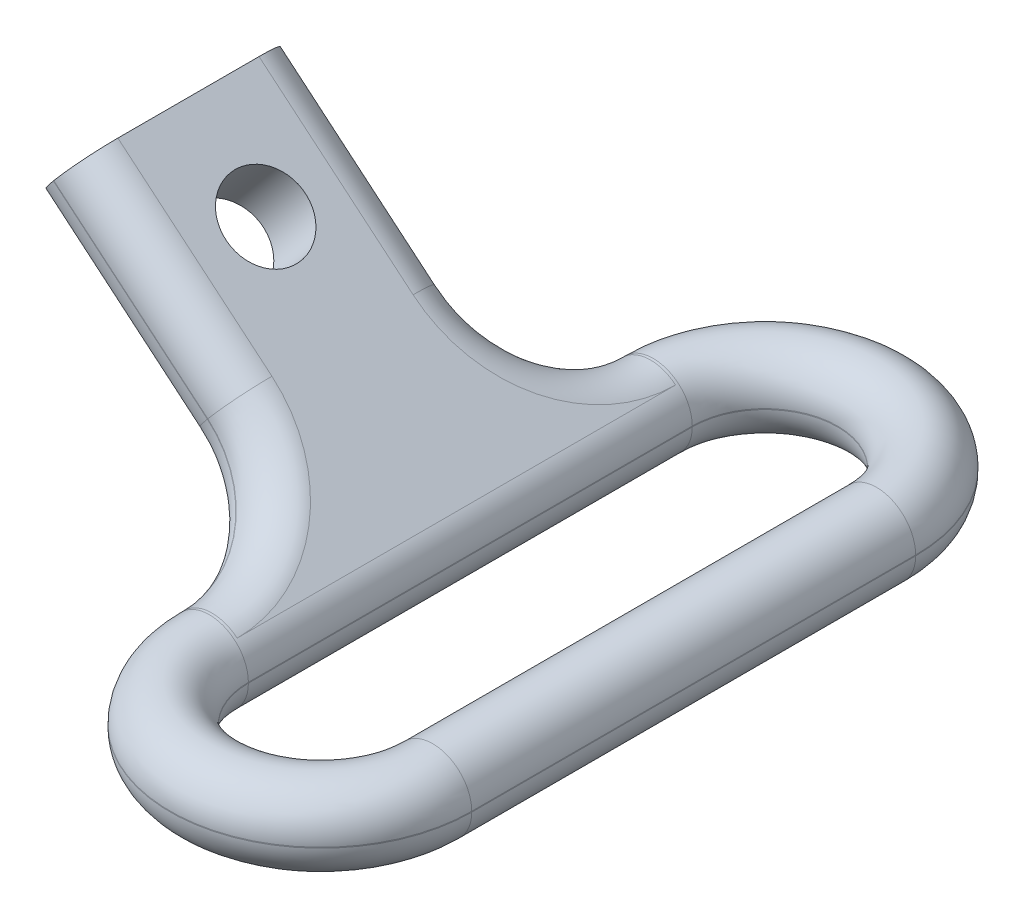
ISO-10303-21;
HEADER;
FILE_DESCRIPTION(('STEP AP214'),'2;1');
FILE_NAME('part.step','',(''),(''),'','','');
FILE_SCHEMA(('AUTOMOTIVE_DESIGN { 1 0 10303 214 1 1 1 1 }'));
ENDSEC;
DATA;
#1=APPLICATION_CONTEXT('core data for automotive mechanical design processes');
#2=APPLICATION_PROTOCOL_DEFINITION('international standard','automotive_design',2000,#1);
#3=PRODUCT_CONTEXT('',#1,'mechanical');
#4=PRODUCT('Part','Part','',(#3));
#5=PRODUCT_RELATED_PRODUCT_CATEGORY('part','',(#4));
#6=PRODUCT_DEFINITION_FORMATION('','',#4);
#7=PRODUCT_DEFINITION_CONTEXT('part definition',#1,'design');
#8=PRODUCT_DEFINITION('design','',#6,#7);
#9=PRODUCT_DEFINITION_SHAPE('','',#8);
#10=(LENGTH_UNIT() NAMED_UNIT(*) SI_UNIT(.MILLI.,.METRE.));
#11=(NAMED_UNIT(*) PLANE_ANGLE_UNIT() SI_UNIT($,.RADIAN.));
#12=(NAMED_UNIT(*) SI_UNIT($,.STERADIAN.) SOLID_ANGLE_UNIT());
#13=UNCERTAINTY_MEASURE_WITH_UNIT(LENGTH_MEASURE(1.E-05),#10,'distance_accuracy_value','');
#14=(GEOMETRIC_REPRESENTATION_CONTEXT(3) GLOBAL_UNCERTAINTY_ASSIGNED_CONTEXT((#13)) GLOBAL_UNIT_ASSIGNED_CONTEXT((#10,
#11,#12)) REPRESENTATION_CONTEXT('',''));
#15=CARTESIAN_POINT('',(0.,0.,0.));
#16=DIRECTION('',(0.,0.,1.));
#17=DIRECTION('',(1.,0.,0.));
#18=AXIS2_PLACEMENT_3D('',#15,#16,#17);
#19=CARTESIAN_POINT('',(-13.0917663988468,5.53037632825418,-12.7));
#20=DIRECTION('',(0.642787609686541,0.766044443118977,0.));
#21=DIRECTION('',(-0.766044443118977,0.642787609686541,0.));
#22=AXIS2_PLACEMENT_3D('',#19,#20,#21);
#23=TOROIDAL_SURFACE('',#22,8.6106,2.2606);
#24=CARTESIAN_POINT('',(-13.0917663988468,5.53037632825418,-12.7));
#25=DIRECTION('',(0.64278760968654,0.766044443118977,0.));
#26=DIRECTION('',(-0.766044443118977,0.64278760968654,0.));
#27=AXIS2_PLACEMENT_3D('',#24,#25,#26);
#28=CIRCLE('',#27,6.35);
#29=CARTESIAN_POINT('',(-13.0917663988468,5.53037632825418,-6.35));
#30=VERTEX_POINT('',#29);
#31=CARTESIAN_POINT('',(-8.22724863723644,1.44856518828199,-12.7));
#32=VERTEX_POINT('',#31);
#33=EDGE_CURVE('E378',#30,#32,#28,.T.);
#34=ORIENTED_EDGE('',*,*,#33,.T.);
#35=CARTESIAN_POINT('',(-8.75621044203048,0.0257326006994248,-12.7));
#36=CARTESIAN_POINT('',(-8.75195717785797,0.425776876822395,-12.7));
#37=CARTESIAN_POINT('',(-8.60525230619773,0.808184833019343,-12.7));
#38=CARTESIAN_POINT('',(-8.47101520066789,1.15809371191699,-12.7));
#39=CARTESIAN_POINT('',(-8.22734062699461,1.44863971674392,-12.7));
#40=B_SPLINE_CURVE_WITH_KNOTS('',2,(#35,#36,#37,#38,#39),.UNSPECIFIED.,.F.,.F.,(3,2,3),(0.,0.5,
1.),.UNSPECIFIED.);
#41=CARTESIAN_POINT('',(-8.7561368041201,0.0257316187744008,-12.7));
#42=VERTEX_POINT('',#41);
#43=EDGE_CURVE('E374',#42,#32,#40,.T.);
#44=ORIENTED_EDGE('',*,*,#43,.F.);
#45=CARTESIAN_POINT('',(-7.94867398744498,-1.73604039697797,-12.7));
#46=CARTESIAN_POINT('',(-8.32321872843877,-1.42192671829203,-12.7));
#47=CARTESIAN_POINT('',(-8.53599445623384,-0.977991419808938,-12.7));
#48=CARTESIAN_POINT('',(-8.7628819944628,-0.504613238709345,-12.7));
#49=CARTESIAN_POINT('',(-8.75621044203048,0.0257326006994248,-12.7));
#50=B_SPLINE_CURVE_WITH_KNOTS('',2,(#45,#46,#47,#48,#49),.UNSPECIFIED.,.F.,.F.,(3,2,3),(0.,0.5,
1.),.UNSPECIFIED.);
#51=CARTESIAN_POINT('',(-7.94869261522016,-1.73606325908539,-12.7));
#52=VERTEX_POINT('',#51);
#53=EDGE_CURVE('E335',#52,#42,#50,.T.);
#54=ORIENTED_EDGE('',*,*,#53,.F.);
#55=CARTESIAN_POINT('',(-7.94874978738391,-1.7361307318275,-12.7));
#56=CARTESIAN_POINT('',(-7.94874749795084,-1.73613265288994,-12.5591092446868));
#57=CARTESIAN_POINT('',(-7.95139866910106,-1.7339080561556,-12.4182187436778));
#58=CARTESIAN_POINT('',(-7.96199149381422,-1.72501962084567,-12.1367770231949));
#59=CARTESIAN_POINT('',(-7.96993314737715,-1.71835578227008,-11.9962258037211));
#60=CARTESIAN_POINT('',(-7.99109049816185,-1.70060265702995,-11.7158014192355));
#61=CARTESIAN_POINT('',(-8.00430619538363,-1.6895133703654,-11.5759282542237));
#62=CARTESIAN_POINT('',(-8.03597907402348,-1.66293666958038,-11.2971968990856));
#63=CARTESIAN_POINT('',(-8.05443625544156,-1.6474492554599,-11.1583387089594));
#64=CARTESIAN_POINT('',(-8.09654783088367,-1.61211344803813,-10.8819718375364));
#65=CARTESIAN_POINT('',(-8.12020222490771,-1.59226505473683,-10.7444631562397));
#66=CARTESIAN_POINT('',(-8.17265118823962,-1.5482551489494,-10.4711265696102));
#67=CARTESIAN_POINT('',(-8.20144575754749,-1.52409363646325,-10.3352986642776));
#68=CARTESIAN_POINT('',(-8.26410571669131,-1.47151568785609,-10.0656508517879));
#69=CARTESIAN_POINT('',(-8.29797110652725,-1.44309925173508,-9.93183094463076));
#70=CARTESIAN_POINT('',(-8.37069111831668,-1.38207991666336,-9.66652151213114));
#71=CARTESIAN_POINT('',(-8.40954574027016,-1.34947701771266,-9.53503198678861));
#72=CARTESIAN_POINT('',(-8.49215061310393,-1.2801632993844,-9.27470008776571));
#73=CARTESIAN_POINT('',(-8.53590086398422,-1.24345248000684,-9.14585771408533));
#74=CARTESIAN_POINT('',(-8.62819159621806,-1.16601136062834,-8.89113051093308));
#75=CARTESIAN_POINT('',(-8.67673207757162,-1.1252810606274,-8.7652456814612));
#76=CARTESIAN_POINT('',(-8.77848633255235,-1.03989910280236,-8.51673683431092));
#77=CARTESIAN_POINT('',(-8.83170010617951,-0.995247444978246,-8.39411281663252));
#78=CARTESIAN_POINT('',(-8.94267274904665,-0.902130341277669,-8.15242100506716));
#79=CARTESIAN_POINT('',(-9.0004316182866,-0.8536648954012,-8.0333532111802));
#80=CARTESIAN_POINT('',(-9.12035530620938,-0.753036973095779,-7.79906069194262));
#81=CARTESIAN_POINT('',(-9.18252012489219,-0.700874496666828,-7.68383596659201));
#82=CARTESIAN_POINT('',(-9.31110595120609,-0.592978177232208,-7.4575071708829));
#83=CARTESIAN_POINT('',(-9.37752695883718,-0.53724433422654,-7.3464031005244));
#84=CARTESIAN_POINT('',(-9.51446514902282,-0.422339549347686,-7.12858327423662));
#85=CARTESIAN_POINT('',(-9.58498233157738,-0.363168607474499,-7.02186751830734));
#86=CARTESIAN_POINT('',(-9.7299429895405,-0.241532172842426,-6.81308140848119));
#87=CARTESIAN_POINT('',(-9.80438646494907,-0.17906668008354,-6.71101105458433));
#88=CARTESIAN_POINT('',(-9.95702036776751,-0.0509916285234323,-6.5117616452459));
#89=CARTESIAN_POINT('',(-10.0352107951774,0.0146179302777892,-6.41458258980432));
#90=CARTESIAN_POINT('',(-10.1951502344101,0.148823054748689,-6.22534989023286));
#91=CARTESIAN_POINT('',(-10.276899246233,0.217418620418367,-6.13329624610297));
#92=CARTESIAN_POINT('',(-10.4437589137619,0.357430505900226,-5.95453613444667));
#93=CARTESIAN_POINT('',(-10.5288695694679,0.428846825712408,-5.86782966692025));
#94=CARTESIAN_POINT('',(-10.7022474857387,0.5743281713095,-5.69997279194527));
#95=CARTESIAN_POINT('',(-10.7905147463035,0.64839319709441,-5.61882238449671));
#96=CARTESIAN_POINT('',(-10.9699932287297,0.798993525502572,-5.46227312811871));
#97=CARTESIAN_POINT('',(-11.0612044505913,0.875528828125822,-5.38687427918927));
#98=CARTESIAN_POINT('',(-11.2463511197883,1.03088532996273,-5.24200978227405));
#99=CARTESIAN_POINT('',(-11.3402865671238,1.10970652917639,-5.17254413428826));
#100=CARTESIAN_POINT('',(-11.5306553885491,1.26944493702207,-5.03971338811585));
#101=CARTESIAN_POINT('',(-11.627088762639,1.3503621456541,-4.97634828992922));
#102=CARTESIAN_POINT('',(-11.8222211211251,1.51409763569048,-4.85587129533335));
#103=CARTESIAN_POINT('',(-11.9209201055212,1.59691591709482,-4.7987593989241));
#104=CARTESIAN_POINT('',(-12.1203459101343,1.76425403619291,-4.69092639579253));
#105=CARTESIAN_POINT('',(-12.2210727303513,1.84877387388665,-4.64020528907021));
#106=CARTESIAN_POINT('',(-12.4243115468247,2.01931148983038,-4.54527605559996));
#107=CARTESIAN_POINT('',(-12.526823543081,2.10532926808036,-4.50106792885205));
#108=CARTESIAN_POINT('',(-12.733385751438,2.27865554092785,-4.41927116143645));
#109=CARTESIAN_POINT('',(-12.8374359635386,2.36596403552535,-4.38168252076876));
#110=CARTESIAN_POINT('',(-13.0468239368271,2.54166140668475,-4.31321526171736));
#111=CARTESIAN_POINT('',(-13.1521616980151,2.63005028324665,-4.28233664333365));
#112=CARTESIAN_POINT('',(-13.3638710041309,2.80769548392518,-4.22736388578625));
#113=CARTESIAN_POINT('',(-13.4702425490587,2.89695180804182,-4.20326974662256));
#114=CARTESIAN_POINT('',(-13.6837631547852,3.07611686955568,-4.16192373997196));
#115=CARTESIAN_POINT('',(-13.7909122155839,3.1660256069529,-4.14467187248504));
#116=CARTESIAN_POINT('',(-14.0057297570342,3.34627892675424,-4.11705291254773));
#117=CARTESIAN_POINT('',(-14.1133982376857,3.43662350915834,-4.10668582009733));
#118=CARTESIAN_POINT('',(-14.3289951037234,3.61753075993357,-4.09285786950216));
#119=CARTESIAN_POINT('',(-14.4369234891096,3.7080934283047,-4.0893970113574));
#120=CARTESIAN_POINT('',(-14.5448520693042,3.79865626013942,-4.0894));
#121=B_SPLINE_CURVE_WITH_KNOTS('',3,(#55,#56,#57,#58,#59,#60,#61,#62,#63,#64,#65,#66,#67,#68,
#69,#70,#71,#72,#73,#74,#75,#76,#77,#78,#79,#80,#81,#82,#83,#84,#85,#86,#87,#88,#89,#90,#91,#92,
#93,#94,#95,#96,#97,#98,#99,#100,#101,#102,#103,#104,#105,#106,#107,#108,#109,#110,#111,#112,
#113,#114,#115,#116,#117,#118,#119,#120),.UNSPECIFIED.,.F.,.F.,(4,2,2,2,2,2,2,2,2,2,2,2,2,2,2,2,
2,2,2,2,2,2,2,2,2,2,2,2,2,2,2,2,4),(0.,0.422629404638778,0.845258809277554,1.26788821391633,
1.69051761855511,2.11314702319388,2.53577642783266,2.95840583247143,3.38103523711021,
3.80366464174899,4.22629404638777,4.64892345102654,5.07155285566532,5.4941822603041,
5.91681166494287,6.33944106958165,6.76207047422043,7.1846998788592,7.60732928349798,
8.02995868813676,8.45258809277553,8.87521749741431,9.29784690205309,9.72047630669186,
10.1431057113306,10.5657351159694,10.9883645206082,11.410993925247,11.8336233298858,
12.2562527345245,12.6788821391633,13.1015115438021,13.5241409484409),.UNSPECIFIED.);
#122=CARTESIAN_POINT('',(-14.5448520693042,3.79865626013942,-4.0894));
#123=VERTEX_POINT('',#122);
#124=EDGE_CURVE('E406',#52,#123,#121,.T.);
#125=ORIENTED_EDGE('',*,*,#124,.T.);
#126=CARTESIAN_POINT('',(-13.0917663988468,5.53037632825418,-4.0894));
#127=DIRECTION('',(0.766044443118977,-0.642787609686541,0.));
#128=DIRECTION('',(0.642787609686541,0.766044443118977,0.));
#129=AXIS2_PLACEMENT_3D('',#126,#127,#128);
#130=CIRCLE('',#129,2.2606);
#131=EDGE_CURVE('E844',#30,#123,#130,.F.);
#132=ORIENTED_EDGE('',*,*,#131,.F.);
#133=EDGE_LOOP('',(#34,#44,#54,#125,#132));
#134=FACE_BOUND('',#133,.T.);
#135=ADVANCED_FACE('F18',(#134),#23,.T.);
#136=CARTESIAN_POINT('',(-18.9950695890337,7.5328321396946,0.));
#137=DIRECTION('',(-0.642787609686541,-0.766044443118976,0.));
#138=DIRECTION('',(0.766044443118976,-0.642787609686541,0.));
#139=AXIS2_PLACEMENT_3D('',#136,#137,#138);
#140=CONICAL_SURFACE('',#139,3.07339999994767,0.785398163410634);
#141=CARTESIAN_POINT('',(-18.5052654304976,8.1165580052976,0.));
#142=DIRECTION('',(0.64278760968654,0.766044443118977,0.));
#143=DIRECTION('',(-0.766044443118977,0.64278760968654,0.));
#144=AXIS2_PLACEMENT_3D('',#141,#142,#143);
#145=CIRCLE('',#144,2.31139999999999);
#146=CARTESIAN_POINT('',(-20.2759005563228,9.60229728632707,0.));
#147=VERTEX_POINT('',#146);
#148=EDGE_CURVE('E853',#147,#147,#145,.T.);
#149=ORIENTED_EDGE('',*,*,#148,.T.);
#150=EDGE_LOOP('',(#149));
#151=FACE_BOUND('',#150,.T.);
#152=CARTESIAN_POINT('',(-18.9950695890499,7.53283213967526,0.));
#153=DIRECTION('',(-0.642787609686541,-0.766044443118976,0.));
#154=DIRECTION('',(-0.766044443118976,0.642787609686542,0.));
#155=AXIS2_PLACEMENT_3D('',#152,#153,#154);
#156=CIRCLE('',#155,3.07339999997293);
#157=CARTESIAN_POINT('',(-21.349430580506,9.50837557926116,0.));
#158=VERTEX_POINT('',#157);
#159=CARTESIAN_POINT('',(-16.6407085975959,5.55728870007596,0.));
#160=VERTEX_POINT('',#159);
#161=EDGE_CURVE('E380',#158,#160,#156,.T.);
#162=ORIENTED_EDGE('',*,*,#161,.T.);
#163=CARTESIAN_POINT('',(-18.9950695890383,7.53283213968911,0.));
#164=DIRECTION('',(-0.642787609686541,-0.766044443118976,0.));
#165=DIRECTION('',(0.766044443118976,-0.642787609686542,0.));
#166=AXIS2_PLACEMENT_3D('',#163,#164,#165);
#167=CIRCLE('',#166,3.07339999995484);
#168=EDGE_CURVE('E379',#160,#158,#167,.T.);
#169=ORIENTED_EDGE('',*,*,#168,.T.);
#170=EDGE_LOOP('',(#162,#169));
#171=FACE_BOUND('',#170,.T.);
#172=ADVANCED_FACE('F661',(#151,#171),#140,.F.);
#173=CARTESIAN_POINT('',(-6.49566411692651,-0.0044106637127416,4.0894));
#174=DIRECTION('',(-0.766044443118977,0.642787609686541,0.));
#175=DIRECTION('',(-0.642787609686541,-0.766044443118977,0.));
#176=AXIS2_PLACEMENT_3D('',#173,#174,#175);
#177=CYLINDRICAL_SURFACE('',#176,2.2606);
#178=CARTESIAN_POINT('',(-22.0172155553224,13.0197174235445,4.0894));
#179=DIRECTION('',(0.766044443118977,-0.642787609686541,0.));
#180=DIRECTION('',(0.,0.,1.));
#181=AXIS2_PLACEMENT_3D('',#178,#179,#180);
#182=CIRCLE('',#181,2.2606);
#183=CARTESIAN_POINT('',(-22.0172155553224,13.0197174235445,6.35));
#184=VERTEX_POINT('',#183);
#185=CARTESIAN_POINT('',(-23.4703012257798,11.2879973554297,4.0894));
#186=VERTEX_POINT('',#185);
#187=EDGE_CURVE('E1242',#184,#186,#182,.T.);
#188=ORIENTED_EDGE('',*,*,#187,.T.);
#189=DIRECTION('',(-0.766044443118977,0.64278760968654,0.));
#190=VECTOR('',#189,1.);
#191=CARTESIAN_POINT('',(-23.4703012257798,11.2879973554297,4.0894));
#192=LINE('',#191,#190);
#193=CARTESIAN_POINT('',(-14.5448520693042,3.79865626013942,4.0894));
#194=VERTEX_POINT('',#193);
#195=EDGE_CURVE('E431',#186,#194,#192,.F.);
#196=ORIENTED_EDGE('',*,*,#195,.T.);
#197=CARTESIAN_POINT('',(-13.0917663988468,5.53037632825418,4.0894));
#198=DIRECTION('',(0.766044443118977,-0.64278760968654,0.));
#199=DIRECTION('',(0.64278760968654,0.766044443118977,0.));
#200=AXIS2_PLACEMENT_3D('',#197,#198,#199);
#201=CIRCLE('',#200,2.2606);
#202=CARTESIAN_POINT('',(-13.0917660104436,5.53037679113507,6.34999999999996));
#203=VERTEX_POINT('',#202);
#204=EDGE_CURVE('E659',#203,#194,#201,.T.);
#205=ORIENTED_EDGE('',*,*,#204,.F.);
#206=DIRECTION('',(0.766044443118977,-0.642787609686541,0.));
#207=VECTOR('',#206,1.);
#208=CARTESIAN_POINT('',(-22.0172155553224,13.0197174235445,6.35));
#209=LINE('',#208,#207);
#210=EDGE_CURVE('E835',#184,#203,#209,.T.);
#211=ORIENTED_EDGE('',*,*,#210,.F.);
#212=EDGE_LOOP('',(#188,#196,#205,#211));
#213=FACE_BOUND('',#212,.T.);
#214=ADVANCED_FACE('F671',(#213),#177,.T.);
#215=CARTESIAN_POINT('',(-22.0172155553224,13.0197174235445,-4.0894));
#216=DIRECTION('',(0.766044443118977,-0.642787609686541,0.));
#217=DIRECTION('',(0.642787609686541,0.766044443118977,0.));
#218=AXIS2_PLACEMENT_3D('',#215,#216,#217);
#219=CYLINDRICAL_SURFACE('',#218,2.2606);
#220=CARTESIAN_POINT('',(-22.0172155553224,13.0197174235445,-4.0894));
#221=DIRECTION('',(0.766044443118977,-0.642787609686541,0.));
#222=DIRECTION('',(-0.64278760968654,-0.766044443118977,0.));
#223=AXIS2_PLACEMENT_3D('',#220,#221,#222);
#224=CIRCLE('',#223,2.2606);
#225=CARTESIAN_POINT('',(-23.4703012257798,11.2879973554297,-4.0894));
#226=VERTEX_POINT('',#225);
#227=CARTESIAN_POINT('',(-22.0172155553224,13.0197174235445,-6.35));
#228=VERTEX_POINT('',#227);
#229=EDGE_CURVE('E303',#226,#228,#224,.T.);
#230=ORIENTED_EDGE('',*,*,#229,.T.);
#231=DIRECTION('',(0.766044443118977,-0.64278760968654,0.));
#232=VECTOR('',#231,1.);
#233=CARTESIAN_POINT('',(-22.0172155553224,13.0197174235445,-6.35));
#234=LINE('',#233,#232);
#235=EDGE_CURVE('E841',#228,#30,#234,.T.);
#236=ORIENTED_EDGE('',*,*,#235,.T.);
#237=ORIENTED_EDGE('',*,*,#131,.T.);
#238=DIRECTION('',(-0.766044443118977,0.64278760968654,0.));
#239=VECTOR('',#238,1.);
#240=CARTESIAN_POINT('',(-23.4703012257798,11.2879973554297,-4.0894));
#241=LINE('',#240,#239);
#242=EDGE_CURVE('E438',#123,#226,#241,.T.);
#243=ORIENTED_EDGE('',*,*,#242,.T.);
#244=EDGE_LOOP('',(#230,#236,#237,#243));
#245=FACE_BOUND('',#244,.T.);
#246=ADVANCED_FACE('F873',(#245),#219,.T.);
#247=CARTESIAN_POINT('',(-6.47065,0.0254000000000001,-6.35));
#248=DIRECTION('',(0.,0.,1.));
#249=DIRECTION('',(1.,0.,0.));
#250=AXIS2_PLACEMENT_3D('',#247,#248,#249);
#251=PLANE('',#250);
#252=DIRECTION('',(0.64278760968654,0.766044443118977,0.));
#253=VECTOR('',#252,1.);
#254=CARTESIAN_POINT('',(-21.4219264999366,-4.39712189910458,-6.35));
#255=LINE('',#254,#253);
#256=CARTESIAN_POINT('',(-13.0667522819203,5.56018699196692,-6.35));
#257=VERTEX_POINT('',#256);
#258=EDGE_CURVE('E377',#257,#30,#255,.F.);
#259=ORIENTED_EDGE('',*,*,#258,.T.);
#260=ORIENTED_EDGE('',*,*,#235,.F.);
#261=DIRECTION('',(0.64278760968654,0.766044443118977,0.));
#262=VECTOR('',#261,1.);
#263=CARTESIAN_POINT('',(-23.4703012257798,11.2879973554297,-6.35));
#264=LINE('',#263,#262);
#265=CARTESIAN_POINT('',(-21.9922014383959,13.0495280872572,-6.35));
#266=VERTEX_POINT('',#265);
#267=EDGE_CURVE('E315',#228,#266,#264,.T.);
#268=ORIENTED_EDGE('',*,*,#267,.T.);
#269=DIRECTION('',(-0.766044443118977,0.64278760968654,0.));
#270=VECTOR('',#269,1.);
#271=CARTESIAN_POINT('',(-6.47065,0.0254000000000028,-6.35));
#272=LINE('',#271,#270);
#273=EDGE_CURVE('E319',#257,#266,#272,.T.);
#274=ORIENTED_EDGE('',*,*,#273,.F.);
#275=EDGE_LOOP('',(#259,#260,#268,#274));
#276=FACE_BOUND('',#275,.T.);
#277=ADVANCED_FACE('F871',(#276),#251,.F.);
#278=CARTESIAN_POINT('',(-6.47065,0.0254000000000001,6.35));
#279=DIRECTION('',(0.,0.,1.));
#280=DIRECTION('',(1.,0.,0.));
#281=AXIS2_PLACEMENT_3D('',#278,#279,#280);
#282=PLANE('',#281);
#283=DIRECTION('',(0.642787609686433,0.766044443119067,0.));
#284=VECTOR('',#283,1.);
#285=CARTESIAN_POINT('',(-13.0917663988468,5.53037632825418,6.35));
#286=LINE('',#285,#284);
#287=CARTESIAN_POINT('',(-13.0667522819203,5.56018699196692,6.35));
#288=VERTEX_POINT('',#287);
#289=EDGE_CURVE('E832',#203,#288,#286,.T.);
#290=ORIENTED_EDGE('',*,*,#289,.T.);
#291=DIRECTION('',(0.766044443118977,-0.64278760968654,0.));
#292=VECTOR('',#291,1.);
#293=CARTESIAN_POINT('',(-6.47065,0.0254000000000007,6.35));
#294=LINE('',#293,#292);
#295=CARTESIAN_POINT('',(-21.9922014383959,13.0495280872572,6.35));
#296=VERTEX_POINT('',#295);
#297=EDGE_CURVE('E829',#296,#288,#294,.T.);
#298=ORIENTED_EDGE('',*,*,#297,.F.);
#299=DIRECTION('',(0.64278760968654,0.766044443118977,0.));
#300=VECTOR('',#299,1.);
#301=CARTESIAN_POINT('',(-23.4703012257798,11.2879973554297,6.35));
#302=LINE('',#301,#300);
#303=EDGE_CURVE('E840',#296,#184,#302,.F.);
#304=ORIENTED_EDGE('',*,*,#303,.T.);
#305=ORIENTED_EDGE('',*,*,#210,.T.);
#306=EDGE_LOOP('',(#290,#298,#304,#305));
#307=FACE_BOUND('',#306,.T.);
#308=ADVANCED_FACE('F545',(#307),#282,.T.);
#309=CARTESIAN_POINT('',(-13.0917663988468,5.53037632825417,12.7));
#310=DIRECTION('',(0.642787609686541,0.766044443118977,0.));
#311=DIRECTION('',(-0.766044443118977,0.642787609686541,0.));
#312=AXIS2_PLACEMENT_3D('',#309,#310,#311);
#313=TOROIDAL_SURFACE('',#312,8.61059999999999,2.2606);
#314=CARTESIAN_POINT('',(-8.22731144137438,1.44861607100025,12.7));
#315=CARTESIAN_POINT('',(-8.47041407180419,1.15883972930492,12.7));
#316=CARTESIAN_POINT('',(-8.60524425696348,0.808101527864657,12.7));
#317=CARTESIAN_POINT('',(-8.75187894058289,0.426655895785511,12.7));
#318=CARTESIAN_POINT('',(-8.75618865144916,0.0257323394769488,12.7));
#319=B_SPLINE_CURVE_WITH_KNOTS('',2,(#314,#315,#316,#317,#318),.UNSPECIFIED.,.F.,.F.,(3,2,3),
(0.,0.5,1.),.UNSPECIFIED.);
#320=CARTESIAN_POINT('',(-8.2272888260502,1.4485981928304,12.7));
#321=VERTEX_POINT('',#320);
#322=CARTESIAN_POINT('',(-8.75612590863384,0.0257315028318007,12.7));
#323=VERTEX_POINT('',#322);
#324=EDGE_CURVE('E709',#321,#323,#319,.T.);
#325=ORIENTED_EDGE('',*,*,#324,.F.);
#326=CARTESIAN_POINT('',(-13.0917653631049,5.53037756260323,12.7));
#327=DIRECTION('',(0.64278760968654,0.766044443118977,0.));
#328=DIRECTION('',(-0.766044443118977,0.64278760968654,0.));
#329=AXIS2_PLACEMENT_3D('',#326,#327,#328);
#330=CIRCLE('',#329,6.35);
#331=EDGE_CURVE('E576',#321,#203,#330,.T.);
#332=ORIENTED_EDGE('',*,*,#331,.T.);
#333=ORIENTED_EDGE('',*,*,#204,.T.);
#334=CARTESIAN_POINT('',(-14.5448520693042,3.79865626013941,4.0894));
#335=CARTESIAN_POINT('',(-14.4369234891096,3.7080934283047,4.08939701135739));
#336=CARTESIAN_POINT('',(-14.3289951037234,3.61753075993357,4.09285786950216));
#337=CARTESIAN_POINT('',(-14.1133982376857,3.43662350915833,4.10668582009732));
#338=CARTESIAN_POINT('',(-14.0057297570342,3.34627892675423,4.11705291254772));
#339=CARTESIAN_POINT('',(-13.7909122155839,3.1660256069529,4.14467187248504));
#340=CARTESIAN_POINT('',(-13.6837631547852,3.07611686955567,4.16192373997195));
#341=CARTESIAN_POINT('',(-13.4702425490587,2.89695180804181,4.20326974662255));
#342=CARTESIAN_POINT('',(-13.3638710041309,2.80769548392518,4.22736388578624));
#343=CARTESIAN_POINT('',(-13.1521616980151,2.63005028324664,4.28233664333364));
#344=CARTESIAN_POINT('',(-13.0468239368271,2.54166140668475,4.31321526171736));
#345=CARTESIAN_POINT('',(-12.8374359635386,2.36596403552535,4.38168252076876));
#346=CARTESIAN_POINT('',(-12.733385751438,2.27865554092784,4.41927116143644));
#347=CARTESIAN_POINT('',(-12.526823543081,2.10532926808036,4.50106792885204));
#348=CARTESIAN_POINT('',(-12.4243115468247,2.01931148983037,4.54527605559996));
#349=CARTESIAN_POINT('',(-12.2210727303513,1.84877387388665,4.6402052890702));
#350=CARTESIAN_POINT('',(-12.1203459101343,1.7642540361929,4.69092639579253));
#351=CARTESIAN_POINT('',(-11.9209201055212,1.59691591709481,4.7987593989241));
#352=CARTESIAN_POINT('',(-11.8222211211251,1.51409763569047,4.85587129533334));
#353=CARTESIAN_POINT('',(-11.627088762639,1.3503621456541,4.97634828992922));
#354=CARTESIAN_POINT('',(-11.5306553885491,1.26944493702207,5.03971338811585));
#355=CARTESIAN_POINT('',(-11.3402865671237,1.10970652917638,5.17254413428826));
#356=CARTESIAN_POINT('',(-11.2463511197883,1.03088532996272,5.24200978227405));
#357=CARTESIAN_POINT('',(-11.0612044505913,0.875528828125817,5.38687427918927));
#358=CARTESIAN_POINT('',(-10.9699932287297,0.798993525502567,5.4622731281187));
#359=CARTESIAN_POINT('',(-10.7905147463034,0.648393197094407,5.6188223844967));
#360=CARTESIAN_POINT('',(-10.7022474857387,0.574328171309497,5.69997279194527));
#361=CARTESIAN_POINT('',(-10.5288695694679,0.428846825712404,5.86782966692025));
#362=CARTESIAN_POINT('',(-10.4437589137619,0.357430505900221,5.95453613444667));
#363=CARTESIAN_POINT('',(-10.276899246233,0.21741862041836,6.13329624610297));
#364=CARTESIAN_POINT('',(-10.1951502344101,0.148823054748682,6.22534989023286));
#365=CARTESIAN_POINT('',(-10.0352107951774,0.0146179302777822,6.41458258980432));
#366=CARTESIAN_POINT('',(-9.95702036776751,-0.0509916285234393,6.5117616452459));
#367=CARTESIAN_POINT('',(-9.80438646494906,-0.179066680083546,6.71101105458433));
#368=CARTESIAN_POINT('',(-9.72994298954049,-0.241532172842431,6.81308140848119));
#369=CARTESIAN_POINT('',(-9.58498233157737,-0.363168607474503,7.02186751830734));
#370=CARTESIAN_POINT('',(-9.51446514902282,-0.42233954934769,7.12858327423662));
#371=CARTESIAN_POINT('',(-9.37752695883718,-0.537244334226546,7.34640310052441));
#372=CARTESIAN_POINT('',(-9.31110595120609,-0.592978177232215,7.4575071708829));
#373=CARTESIAN_POINT('',(-9.18252012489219,-0.700874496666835,7.68383596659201));
#374=CARTESIAN_POINT('',(-9.12035530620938,-0.753036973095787,7.79906069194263));
#375=CARTESIAN_POINT('',(-9.0004316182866,-0.853664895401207,8.0333532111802));
#376=CARTESIAN_POINT('',(-8.94267274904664,-0.902130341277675,8.15242100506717));
#377=CARTESIAN_POINT('',(-8.83170010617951,-0.995247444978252,8.39411281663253));
#378=CARTESIAN_POINT('',(-8.77848633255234,-1.03989910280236,8.51673683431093));
#379=CARTESIAN_POINT('',(-8.67673207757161,-1.12528106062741,8.76524568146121));
#380=CARTESIAN_POINT('',(-8.62819159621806,-1.16601136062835,8.89113051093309));
#381=CARTESIAN_POINT('',(-8.53590086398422,-1.24345248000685,9.14585771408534));
#382=CARTESIAN_POINT('',(-8.49215061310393,-1.28016329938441,9.27470008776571));
#383=CARTESIAN_POINT('',(-8.40954574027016,-1.34947701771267,9.53503198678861));
#384=CARTESIAN_POINT('',(-8.37069111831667,-1.38207991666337,9.66652151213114));
#385=CARTESIAN_POINT('',(-8.29797110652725,-1.44309925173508,9.93183094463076));
#386=CARTESIAN_POINT('',(-8.26410571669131,-1.4715156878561,10.0656508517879));
#387=CARTESIAN_POINT('',(-8.20144575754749,-1.52409363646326,10.3352986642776));
#388=CARTESIAN_POINT('',(-8.17265118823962,-1.5482551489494,10.4711265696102));
#389=CARTESIAN_POINT('',(-8.12020222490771,-1.59226505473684,10.7444631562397));
#390=CARTESIAN_POINT('',(-8.09654783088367,-1.61211344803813,10.8819718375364));
#391=CARTESIAN_POINT('',(-8.05443625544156,-1.6474492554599,11.1583387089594));
#392=CARTESIAN_POINT('',(-8.03597907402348,-1.66293666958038,11.2971968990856));
#393=CARTESIAN_POINT('',(-8.00430619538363,-1.68951337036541,11.5759282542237));
#394=CARTESIAN_POINT('',(-7.99109049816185,-1.70060265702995,11.7158014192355));
#395=CARTESIAN_POINT('',(-7.96993314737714,-1.71835578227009,11.9962258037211));
#396=CARTESIAN_POINT('',(-7.96199149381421,-1.72501962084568,12.1367770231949));
#397=CARTESIAN_POINT('',(-7.95139866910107,-1.73390805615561,12.4182187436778));
#398=CARTESIAN_POINT('',(-7.94874749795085,-1.73613265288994,12.5591092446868));
#399=CARTESIAN_POINT('',(-7.94874978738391,-1.73613073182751,12.7));
#400=B_SPLINE_CURVE_WITH_KNOTS('',3,(#334,#335,#336,#337,#338,#339,#340,#341,#342,#343,#344,
#345,#346,#347,#348,#349,#350,#351,#352,#353,#354,#355,#356,#357,#358,#359,#360,#361,#362,#363,
#364,#365,#366,#367,#368,#369,#370,#371,#372,#373,#374,#375,#376,#377,#378,#379,#380,#381,#382,
#383,#384,#385,#386,#387,#388,#389,#390,#391,#392,#393,#394,#395,#396,#397,#398,#399),
.UNSPECIFIED.,.F.,.F.,(4,2,2,2,2,2,2,2,2,2,2,2,2,2,2,2,2,2,2,2,2,2,2,2,2,2,2,2,2,2,2,2,4),(0.,
0.422629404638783,0.845258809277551,1.26788821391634,1.6905176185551,2.11314702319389,
2.53577642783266,2.95840583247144,3.38103523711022,3.803664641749,4.22629404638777,
4.64892345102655,5.07155285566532,5.4941822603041,5.91681166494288,6.33944106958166,
6.76207047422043,7.18469987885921,7.60732928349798,8.02995868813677,8.45258809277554,
8.87521749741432,9.2978469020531,9.72047630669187,10.1431057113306,10.5657351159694,
10.9883645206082,11.410993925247,11.8336233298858,12.2562527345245,12.6788821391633,
13.1015115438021,13.5241409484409),.UNSPECIFIED.);
#401=CARTESIAN_POINT('',(-7.94869261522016,-1.7360632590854,12.7));
#402=VERTEX_POINT('',#401);
#403=EDGE_CURVE('E393',#194,#402,#400,.T.);
#404=ORIENTED_EDGE('',*,*,#403,.T.);
#405=CARTESIAN_POINT('',(-8.75618865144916,0.0257323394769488,12.7));
#406=CARTESIAN_POINT('',(-8.76276080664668,-0.503987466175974,12.7));
#407=CARTESIAN_POINT('',(-8.53597586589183,-0.977949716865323,12.7));
#408=CARTESIAN_POINT('',(-8.32375319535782,-1.4214779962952,12.7));
#409=CARTESIAN_POINT('',(-7.94867398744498,-1.73604039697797,12.7));
#410=B_SPLINE_CURVE_WITH_KNOTS('',2,(#405,#406,#407,#408,#409),.UNSPECIFIED.,.F.,.F.,(3,2,3),
(0.,0.5,1.),.UNSPECIFIED.);
#411=EDGE_CURVE('E442',#323,#402,#410,.T.);
#412=ORIENTED_EDGE('',*,*,#411,.F.);
#413=EDGE_LOOP('',(#325,#332,#333,#404,#412));
#414=FACE_BOUND('',#413,.T.);
#415=ADVANCED_FACE('F544',(#414),#313,.T.);
#416=CARTESIAN_POINT('',(-16.5575442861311,-8.47882322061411,12.7));
#417=DIRECTION('',(0.,0.,1.));
#418=DIRECTION('',(1.,0.,0.));
#419=AXIS2_PLACEMENT_3D('',#416,#417,#418);
#420=PLANE('',#419);
#421=ORIENTED_EDGE('',*,*,#411,.T.);
#422=CARTESIAN_POINT('',(-6.47065000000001,-0.0254000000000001,12.7));
#423=DIRECTION('',(0.,0.,1.));
#424=DIRECTION('',(-1.,0.,0.));
#425=AXIS2_PLACEMENT_3D('',#422,#423,#424);
#426=CIRCLE('',#425,2.2606);
#427=CARTESIAN_POINT('',(-8.73125000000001,-0.0254000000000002,12.7));
#428=VERTEX_POINT('',#427);
#429=EDGE_CURVE('E573',#428,#402,#426,.T.);
#430=ORIENTED_EDGE('',*,*,#429,.F.);
#431=DIRECTION('',(0.,1.,0.));
#432=VECTOR('',#431,1.);
#433=CARTESIAN_POINT('',(-8.73125000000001,-8.47882322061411,12.7));
#434=LINE('',#433,#432);
#435=CARTESIAN_POINT('',(-8.73125000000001,0.0254000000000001,12.7));
#436=VERTEX_POINT('',#435);
#437=EDGE_CURVE('E575',#428,#436,#434,.T.);
#438=ORIENTED_EDGE('',*,*,#437,.T.);
#439=CARTESIAN_POINT('',(-8.73125000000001,0.0254000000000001,12.7));
#440=CARTESIAN_POINT('',(-8.73107220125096,0.414226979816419,12.7));
#441=CARTESIAN_POINT('',(-8.60148066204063,0.780292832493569,12.7));
#442=CARTESIAN_POINT('',(-8.47198708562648,1.14608196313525,12.7));
#443=CARTESIAN_POINT('',(-8.22731144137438,1.44861607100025,12.7));
#444=B_SPLINE_CURVE_WITH_KNOTS('',2,(#439,#440,#441,#442,#443),.UNSPECIFIED.,.F.,.F.,(3,2,3),
(0.,0.5,1.),.UNSPECIFIED.);
#445=EDGE_CURVE('E530',#436,#321,#444,.T.);
#446=ORIENTED_EDGE('',*,*,#445,.T.);
#447=ORIENTED_EDGE('',*,*,#324,.T.);
#448=EDGE_LOOP('',(#421,#430,#438,#446,#447));
#449=FACE_BOUND('',#448,.T.);
#450=ADVANCED_FACE('F535',(#449),#420,.T.);
#451=CARTESIAN_POINT('',(-23.4703012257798,11.2879973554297,6.35));
#452=DIRECTION('',(0.64278760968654,0.766044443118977,0.));
#453=DIRECTION('',(-0.766044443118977,0.64278760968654,0.));
#454=AXIS2_PLACEMENT_3D('',#451,#452,#453);
#455=PLANE('',#454);
#456=ORIENTED_EDGE('',*,*,#161,.F.);
#457=ORIENTED_EDGE('',*,*,#168,.F.);
#458=EDGE_LOOP('',(#456,#457));
#459=FACE_BOUND('',#458,.T.);
#460=CARTESIAN_POINT('',(-7.94859689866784,-1.7359511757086,-6.35));
#461=DIRECTION('',(0.,0.,-1.));
#462=VECTOR('',#461,1.);
#463=LINE('',#460,#462);
#464=CARTESIAN_POINT('',(-7.94867334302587,-1.73604095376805,-6.35));
#465=VERTEX_POINT('',#464);
#466=EDGE_CURVE('E449',#465,#52,#463,.T.);
#467=ORIENTED_EDGE('',*,*,#466,.F.);
#468=CARTESIAN_POINT('',(-6.47065,-0.0254000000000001,-6.35));
#469=DIRECTION('',(0.,0.,-1.));
#470=DIRECTION('',(-0.64278760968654,-0.766044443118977,0.));
#471=AXIS2_PLACEMENT_3D('',#468,#469,#470);
#472=CIRCLE('',#471,2.2606);
#473=CARTESIAN_POINT('',(-7.92373567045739,-1.75712006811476,-6.35));
#474=VERTEX_POINT('',#473);
#475=EDGE_CURVE('E743',#474,#465,#472,.T.);
#476=ORIENTED_EDGE('',*,*,#475,.F.);
#477=DIRECTION('',(0.,0.,-1.));
#478=VECTOR('',#477,1.);
#479=CARTESIAN_POINT('',(-7.9237356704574,-1.75712006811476,12.85875));
#480=LINE('',#479,#478);
#481=CARTESIAN_POINT('',(-7.9237356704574,-1.75712006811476,6.35));
#482=VERTEX_POINT('',#481);
#483=EDGE_CURVE('E744',#482,#474,#480,.T.);
#484=ORIENTED_EDGE('',*,*,#483,.F.);
#485=CARTESIAN_POINT('',(-6.47065,-0.0254000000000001,6.35));
#486=DIRECTION('',(0.,0.,1.));
#487=DIRECTION('',(-0.653785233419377,-0.75668016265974,0.));
#488=AXIS2_PLACEMENT_3D('',#485,#486,#487);
#489=CIRCLE('',#488,2.2606);
#490=CARTESIAN_POINT('',(-7.94867334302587,-1.73604095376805,6.35));
#491=VERTEX_POINT('',#490);
#492=EDGE_CURVE('E496',#491,#482,#489,.T.);
#493=ORIENTED_EDGE('',*,*,#492,.F.);
#494=CARTESIAN_POINT('',(-7.94859689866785,-1.73595117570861,12.7));
#495=DIRECTION('',(0.,0.,-1.));
#496=VECTOR('',#495,1.);
#497=LINE('',#494,#496);
#498=EDGE_CURVE('E507',#402,#491,#497,.T.);
#499=ORIENTED_EDGE('',*,*,#498,.F.);
#500=ORIENTED_EDGE('',*,*,#403,.F.);
#501=ORIENTED_EDGE('',*,*,#195,.F.);
#502=DIRECTION('',(0.,0.,1.));
#503=VECTOR('',#502,1.);
#504=CARTESIAN_POINT('',(-23.4703012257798,11.2879973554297,6.35));
#505=LINE('',#504,#503);
#506=EDGE_CURVE('E876',#186,#226,#505,.F.);
#507=ORIENTED_EDGE('',*,*,#506,.T.);
#508=ORIENTED_EDGE('',*,*,#242,.F.);
#509=ORIENTED_EDGE('',*,*,#124,.F.);
#510=EDGE_LOOP('',(#467,#476,#484,#493,#499,#500,#501,#507,#508,#509));
#511=FACE_BOUND('',#510,.T.);
#512=ADVANCED_FACE('F351',(#459,#511),#455,.F.);
#513=CARTESIAN_POINT('',(-16.5575442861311,-8.47882322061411,-12.7));
#514=DIRECTION('',(0.,0.,-1.));
#515=DIRECTION('',(-1.,0.,0.));
#516=AXIS2_PLACEMENT_3D('',#513,#514,#515);
#517=PLANE('',#516);
#518=ORIENTED_EDGE('',*,*,#43,.T.);
#519=CARTESIAN_POINT('',(-8.22734062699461,1.44863971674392,-12.7));
#520=CARTESIAN_POINT('',(-8.47138056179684,1.14677282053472,-12.7));
#521=CARTESIAN_POINT('',(-8.60148916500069,0.780294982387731,-12.7));
#522=CARTESIAN_POINT('',(-8.73107171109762,0.415298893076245,-12.7));
#523=CARTESIAN_POINT('',(-8.73124999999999,0.0254000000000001,-12.7));
#524=B_SPLINE_CURVE_WITH_KNOTS('',2,(#519,#520,#521,#522,#523),.UNSPECIFIED.,.F.,.F.,(3,2,3),
(0.,0.5,1.),.UNSPECIFIED.);
#525=CARTESIAN_POINT('',(-8.73124999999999,0.0254000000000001,-12.7));
#526=VERTEX_POINT('',#525);
#527=EDGE_CURVE('E371',#32,#526,#524,.T.);
#528=ORIENTED_EDGE('',*,*,#527,.T.);
#529=DIRECTION('',(0.,1.,0.));
#530=VECTOR('',#529,1.);
#531=CARTESIAN_POINT('',(-8.73124999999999,-8.47882322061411,-12.7));
#532=LINE('',#531,#530);
#533=CARTESIAN_POINT('',(-8.73124999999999,-0.0254000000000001,-12.7));
#534=VERTEX_POINT('',#533);
#535=EDGE_CURVE('E372',#526,#534,#532,.F.);
#536=ORIENTED_EDGE('',*,*,#535,.T.);
#537=CARTESIAN_POINT('',(-6.47064999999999,-0.0254000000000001,-12.7));
#538=DIRECTION('',(0.,0.,-1.));
#539=DIRECTION('',(-1.,0.,0.));
#540=AXIS2_PLACEMENT_3D('',#537,#538,#539);
#541=CIRCLE('',#540,2.2606);
#542=EDGE_CURVE('E242',#52,#534,#541,.T.);
#543=ORIENTED_EDGE('',*,*,#542,.F.);
#544=ORIENTED_EDGE('',*,*,#53,.T.);
#545=EDGE_LOOP('',(#518,#528,#536,#543,#544));
#546=FACE_BOUND('',#545,.T.);
#547=ADVANCED_FACE('F341',(#546),#517,.T.);
#548=CARTESIAN_POINT('',(-21.4219264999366,-4.39712189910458,-12.7));
#549=DIRECTION('',(0.64278760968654,0.766044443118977,0.));
#550=DIRECTION('',(-0.766044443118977,0.64278760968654,0.));
#551=AXIS2_PLACEMENT_3D('',#548,#549,#550);
#552=CYLINDRICAL_SURFACE('',#551,6.35);
#553=CARTESIAN_POINT('',(-6.47064999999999,0.0254000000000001,-12.7));
#554=DIRECTION('',(0.,0.,-1.));
#555=DIRECTION('',(-0.776994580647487,0.629507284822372,0.));
#556=AXIS2_PLACEMENT_3D('',#553,#554,#555);
#557=CIRCLE('',#556,2.2606);
#558=CARTESIAN_POINT('',(-8.20237006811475,1.47848567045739,-12.7));
#559=VERTEX_POINT('',#558);
#560=EDGE_CURVE('E216',#32,#559,#557,.T.);
#561=ORIENTED_EDGE('',*,*,#560,.F.);
#562=ORIENTED_EDGE('',*,*,#33,.F.);
#563=ORIENTED_EDGE('',*,*,#258,.F.);
#564=CARTESIAN_POINT('',(-13.0667522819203,5.56018699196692,-12.7));
#565=DIRECTION('',(-0.64278760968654,-0.766044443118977,0.));
#566=DIRECTION('',(0.766044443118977,-0.64278760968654,0.));
#567=AXIS2_PLACEMENT_3D('',#564,#565,#566);
#568=CIRCLE('',#567,6.35);
#569=EDGE_CURVE('E234',#559,#257,#568,.T.);
#570=ORIENTED_EDGE('',*,*,#569,.F.);
#571=EDGE_LOOP('',(#561,#562,#563,#570));
#572=FACE_BOUND('',#571,.T.);
#573=ADVANCED_FACE('F350',(#572),#552,.F.);
#574=CARTESIAN_POINT('',(-16.0638841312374,11.0260829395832,0.));
#575=DIRECTION('',(0.64278760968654,0.766044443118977,0.));
#576=DIRECTION('',(-0.766044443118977,0.64278760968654,0.));
#577=AXIS2_PLACEMENT_3D('',#574,#575,#576);
#578=CYLINDRICAL_SURFACE('',#577,2.31139999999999);
#579=ORIENTED_EDGE('',*,*,#148,.F.);
#580=EDGE_LOOP('',(#579));
#581=FACE_BOUND('',#580,.T.);
#582=CARTESIAN_POINT('',(-16.0638841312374,11.0260829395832,0.));
#583=DIRECTION('',(0.64278760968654,0.766044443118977,0.));
#584=DIRECTION('',(-0.766044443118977,0.64278760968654,0.));
#585=AXIS2_PLACEMENT_3D('',#582,#583,#584);
#586=CIRCLE('',#585,2.31139999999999);
#587=CARTESIAN_POINT('',(-17.8345192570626,12.5118222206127,0.));
#588=VERTEX_POINT('',#587);
#589=EDGE_CURVE('E236',#588,#588,#586,.T.);
#590=ORIENTED_EDGE('',*,*,#589,.T.);
#591=EDGE_LOOP('',(#590));
#592=FACE_BOUND('',#591,.T.);
#593=ADVANCED_FACE('F279',(#581,#592),#578,.F.);
#594=CARTESIAN_POINT('',(-23.4703012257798,11.2879973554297,6.35));
#595=DIRECTION('',(0.766044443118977,-0.64278760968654,0.));
#596=DIRECTION('',(0.64278760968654,0.766044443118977,0.));
#597=AXIS2_PLACEMENT_3D('',#594,#595,#596);
#598=PLANE('',#597);
#599=ORIENTED_EDGE('',*,*,#267,.F.);
#600=ORIENTED_EDGE('',*,*,#229,.F.);
#601=ORIENTED_EDGE('',*,*,#506,.F.);
#602=ORIENTED_EDGE('',*,*,#187,.F.);
#603=ORIENTED_EDGE('',*,*,#303,.F.);
#604=CARTESIAN_POINT('',(-21.9922014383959,13.0495280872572,4.0894));
#605=DIRECTION('',(0.766044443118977,-0.64278760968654,0.));
#606=DIRECTION('',(0.642787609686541,0.766044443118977,0.));
#607=AXIS2_PLACEMENT_3D('',#604,#605,#606);
#608=CIRCLE('',#607,2.2606);
#609=CARTESIAN_POINT('',(-20.5391157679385,14.781248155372,4.0894));
#610=VERTEX_POINT('',#609);
#611=EDGE_CURVE('E260',#610,#296,#608,.T.);
#612=ORIENTED_EDGE('',*,*,#611,.F.);
#613=DIRECTION('',(0.,0.,1.));
#614=VECTOR('',#613,1.);
#615=CARTESIAN_POINT('',(-20.5391157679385,14.781248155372,6.35));
#616=LINE('',#615,#614);
#617=CARTESIAN_POINT('',(-20.5391157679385,14.781248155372,-4.0894));
#618=VERTEX_POINT('',#617);
#619=EDGE_CURVE('E252',#610,#618,#616,.F.);
#620=ORIENTED_EDGE('',*,*,#619,.T.);
#621=CARTESIAN_POINT('',(-21.9922014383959,13.0495280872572,-4.0894));
#622=DIRECTION('',(0.766044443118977,-0.64278760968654,0.));
#623=DIRECTION('',(0.,0.,-1.));
#624=AXIS2_PLACEMENT_3D('',#621,#622,#623);
#625=CIRCLE('',#624,2.2606);
#626=EDGE_CURVE('E313',#266,#618,#625,.T.);
#627=ORIENTED_EDGE('',*,*,#626,.F.);
#628=EDGE_LOOP('',(#599,#600,#601,#602,#603,#612,#620,#627));
#629=FACE_BOUND('',#628,.T.);
#630=ADVANCED_FACE('F268',(#629),#598,.F.);
#631=CARTESIAN_POINT('',(-6.47065,0.0253999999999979,-4.0894));
#632=DIRECTION('',(-0.766044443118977,0.64278760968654,0.));
#633=DIRECTION('',(-0.64278760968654,-0.766044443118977,0.));
#634=AXIS2_PLACEMENT_3D('',#631,#632,#633);
#635=CYLINDRICAL_SURFACE('',#634,2.2606);
#636=ORIENTED_EDGE('',*,*,#626,.T.);
#637=DIRECTION('',(0.766044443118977,-0.64278760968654,0.));
#638=VECTOR('',#637,1.);
#639=CARTESIAN_POINT('',(-5.01756432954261,1.75712006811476,-4.0894));
#640=LINE('',#639,#638);
#641=CARTESIAN_POINT('',(-11.6136666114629,7.29190706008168,-4.0894));
#642=VERTEX_POINT('',#641);
#643=EDGE_CURVE('E202',#618,#642,#640,.T.);
#644=ORIENTED_EDGE('',*,*,#643,.T.);
#645=CARTESIAN_POINT('',(-13.0667522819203,5.56018699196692,-4.0894));
#646=DIRECTION('',(0.766044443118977,-0.64278760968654,0.));
#647=DIRECTION('',(0.64278760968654,0.766044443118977,0.));
#648=AXIS2_PLACEMENT_3D('',#645,#646,#647);
#649=CIRCLE('',#648,2.2606);
#650=EDGE_CURVE('E198',#257,#642,#649,.T.);
#651=ORIENTED_EDGE('',*,*,#650,.F.);
#652=ORIENTED_EDGE('',*,*,#273,.T.);
#653=EDGE_LOOP('',(#636,#644,#651,#652));
#654=FACE_BOUND('',#653,.T.);
#655=ADVANCED_FACE('F278',(#654),#635,.T.);
#656=CARTESIAN_POINT('',(-6.47065,0.0253999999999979,4.0894));
#657=DIRECTION('',(0.766044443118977,-0.64278760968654,0.));
#658=DIRECTION('',(0.64278760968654,0.766044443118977,0.));
#659=AXIS2_PLACEMENT_3D('',#656,#657,#658);
#660=CYLINDRICAL_SURFACE('',#659,2.2606);
#661=ORIENTED_EDGE('',*,*,#611,.T.);
#662=ORIENTED_EDGE('',*,*,#297,.T.);
#663=CARTESIAN_POINT('',(-13.0667522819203,5.56018699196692,4.0894));
#664=DIRECTION('',(0.766044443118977,-0.642787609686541,0.));
#665=DIRECTION('',(0.64278760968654,0.766044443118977,0.));
#666=AXIS2_PLACEMENT_3D('',#663,#664,#665);
#667=CIRCLE('',#666,2.2606);
#668=CARTESIAN_POINT('',(-11.6136666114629,7.29190706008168,4.0894));
#669=VERTEX_POINT('',#668);
#670=EDGE_CURVE('E243',#669,#288,#667,.T.);
#671=ORIENTED_EDGE('',*,*,#670,.F.);
#672=DIRECTION('',(0.766044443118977,-0.64278760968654,0.));
#673=VECTOR('',#672,1.);
#674=CARTESIAN_POINT('',(-5.01756432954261,1.75712006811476,4.0894));
#675=LINE('',#674,#673);
#676=EDGE_CURVE('E254',#669,#610,#675,.F.);
#677=ORIENTED_EDGE('',*,*,#676,.T.);
#678=EDGE_LOOP('',(#661,#662,#671,#677));
#679=FACE_BOUND('',#678,.T.);
#680=ADVANCED_FACE('F826',(#679),#660,.T.);
#681=CARTESIAN_POINT('',(-21.4219264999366,-4.39712189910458,12.7));
#682=DIRECTION('',(0.64278760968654,0.766044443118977,0.));
#683=DIRECTION('',(-0.766044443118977,0.64278760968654,0.));
#684=AXIS2_PLACEMENT_3D('',#681,#682,#683);
#685=CYLINDRICAL_SURFACE('',#684,6.35);
#686=ORIENTED_EDGE('',*,*,#289,.F.);
#687=ORIENTED_EDGE('',*,*,#331,.F.);
#688=CARTESIAN_POINT('',(-6.47065000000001,0.0254000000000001,12.7));
#689=DIRECTION('',(0.,0.,1.));
#690=DIRECTION('',(-0.766044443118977,0.64278760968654,0.));
#691=AXIS2_PLACEMENT_3D('',#688,#689,#690);
#692=CIRCLE('',#691,2.2606);
#693=CARTESIAN_POINT('',(-8.20237006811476,1.47848567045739,12.7));
#694=VERTEX_POINT('',#693);
#695=EDGE_CURVE('E597',#694,#321,#692,.T.);
#696=ORIENTED_EDGE('',*,*,#695,.F.);
#697=CARTESIAN_POINT('',(-13.0667522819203,5.56018699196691,12.7));
#698=DIRECTION('',(-0.64278760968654,-0.766044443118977,0.));
#699=DIRECTION('',(0.766044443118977,-0.64278760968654,0.));
#700=AXIS2_PLACEMENT_3D('',#697,#698,#699);
#701=CIRCLE('',#700,6.35);
#702=EDGE_CURVE('E246',#288,#694,#701,.T.);
#703=ORIENTED_EDGE('',*,*,#702,.F.);
#704=EDGE_LOOP('',(#686,#687,#696,#703));
#705=FACE_BOUND('',#704,.T.);
#706=ADVANCED_FACE('F465',(#705),#685,.F.);
#707=CARTESIAN_POINT('',(-6.47065000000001,-0.0254000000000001,12.85875));
#708=DIRECTION('',(0.,0.,-1.));
#709=DIRECTION('',(-1.,0.,0.));
#710=AXIS2_PLACEMENT_3D('',#707,#708,#709);
#711=CYLINDRICAL_SURFACE('',#710,2.2606);
#712=CARTESIAN_POINT('',(-6.47065000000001,-0.0254000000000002,-12.8587499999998));
#713=DIRECTION('',(0.,0.,-1.));
#714=DIRECTION('',(-1.,0.,0.));
#715=AXIS2_PLACEMENT_3D('',#712,#713,#714);
#716=CIRCLE('',#715,2.2606);
#717=CARTESIAN_POINT('',(-4.21005,-0.0254,-12.8587499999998));
#718=VERTEX_POINT('',#717);
#719=CARTESIAN_POINT('',(-8.73125,-0.0254000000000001,-12.8587499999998));
#720=VERTEX_POINT('',#719);
#721=EDGE_CURVE('E219',#718,#720,#716,.T.);
#722=ORIENTED_EDGE('',*,*,#721,.F.);
#723=DIRECTION('',(0.,0.,1.));
#724=VECTOR('',#723,1.);
#725=CARTESIAN_POINT('',(-4.21005000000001,-0.0254,12.85875));
#726=LINE('',#725,#724);
#727=CARTESIAN_POINT('',(-4.21005000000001,-0.0254,12.85875));
#728=VERTEX_POINT('',#727);
#729=EDGE_CURVE('E585',#718,#728,#726,.T.);
#730=ORIENTED_EDGE('',*,*,#729,.T.);
#731=CARTESIAN_POINT('',(-6.47065000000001,-0.0254000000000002,12.85875));
#732=DIRECTION('',(0.,0.,1.));
#733=DIRECTION('',(0.,-1.,0.));
#734=AXIS2_PLACEMENT_3D('',#731,#732,#733);
#735=CIRCLE('',#734,2.2606);
#736=CARTESIAN_POINT('',(-8.73125000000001,-0.0254000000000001,12.85875));
#737=VERTEX_POINT('',#736);
#738=EDGE_CURVE('E239',#737,#728,#735,.T.);
#739=ORIENTED_EDGE('',*,*,#738,.F.);
#740=DIRECTION('',(0.,0.,-1.));
#741=VECTOR('',#740,1.);
#742=CARTESIAN_POINT('',(-8.73125000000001,-0.0254000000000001,12.85875));
#743=LINE('',#742,#741);
#744=EDGE_CURVE('E579',#737,#428,#743,.T.);
#745=ORIENTED_EDGE('',*,*,#744,.T.);
#746=ORIENTED_EDGE('',*,*,#429,.T.);
#747=ORIENTED_EDGE('',*,*,#498,.T.);
#748=ORIENTED_EDGE('',*,*,#492,.T.);
#749=ORIENTED_EDGE('',*,*,#483,.T.);
#750=ORIENTED_EDGE('',*,*,#475,.T.);
#751=ORIENTED_EDGE('',*,*,#466,.T.);
#752=ORIENTED_EDGE('',*,*,#542,.T.);
#753=DIRECTION('',(0.,0.,-1.));
#754=VECTOR('',#753,1.);
#755=CARTESIAN_POINT('',(-8.73125000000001,-0.0254000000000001,12.85875));
#756=LINE('',#755,#754);
#757=EDGE_CURVE('E384',#534,#720,#756,.T.);
#758=ORIENTED_EDGE('',*,*,#757,.T.);
#759=EDGE_LOOP('',(#722,#730,#739,#745,#746,#747,#748,#749,#750,#751,#752,#758));
#760=FACE_BOUND('',#759,.T.);
#761=ADVANCED_FACE('F455',(#760),#711,.T.);
#762=CARTESIAN_POINT('',(-13.0667522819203,5.56018699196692,-12.7));
#763=DIRECTION('',(-0.64278760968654,-0.766044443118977,0.));
#764=DIRECTION('',(0.766044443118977,-0.64278760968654,0.));
#765=AXIS2_PLACEMENT_3D('',#762,#763,#764);
#766=TOROIDAL_SURFACE('',#765,8.6106,2.2606);
#767=CARTESIAN_POINT('',(-6.47064999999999,0.0254000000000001,-12.7));
#768=DIRECTION('',(0.,0.,-1.));
#769=DIRECTION('',(-1.,0.,0.));
#770=AXIS2_PLACEMENT_3D('',#767,#768,#769);
#771=CIRCLE('',#770,2.2606);
#772=CARTESIAN_POINT('',(-5.01756432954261,1.75712006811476,-12.7));
#773=VERTEX_POINT('',#772);
#774=EDGE_CURVE('E196',#559,#773,#771,.T.);
#775=ORIENTED_EDGE('',*,*,#774,.F.);
#776=ORIENTED_EDGE('',*,*,#569,.T.);
#777=ORIENTED_EDGE('',*,*,#650,.T.);
#778=CARTESIAN_POINT('',(-11.6136666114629,7.29190706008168,-12.7));
#779=DIRECTION('',(-0.64278760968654,-0.766044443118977,0.));
#780=DIRECTION('',(0.766044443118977,-0.64278760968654,0.));
#781=AXIS2_PLACEMENT_3D('',#778,#779,#780);
#782=CIRCLE('',#781,8.6106);
#783=EDGE_CURVE('E191',#642,#773,#782,.F.);
#784=ORIENTED_EDGE('',*,*,#783,.T.);
#785=EDGE_LOOP('',(#775,#776,#777,#784));
#786=FACE_BOUND('',#785,.T.);
#787=ADVANCED_FACE('F193',(#786),#766,.T.);
#788=CARTESIAN_POINT('',(-5.01756432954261,1.75712006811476,6.35));
#789=DIRECTION('',(-0.64278760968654,-0.766044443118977,0.));
#790=DIRECTION('',(0.766044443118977,-0.64278760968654,0.));
#791=AXIS2_PLACEMENT_3D('',#788,#789,#790);
#792=PLANE('',#791);
#793=ORIENTED_EDGE('',*,*,#643,.F.);
#794=ORIENTED_EDGE('',*,*,#619,.F.);
#795=ORIENTED_EDGE('',*,*,#676,.F.);
#796=CARTESIAN_POINT('',(-11.6136666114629,7.29190706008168,12.7));
#797=DIRECTION('',(-0.64278760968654,-0.766044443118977,0.));
#798=DIRECTION('',(0.766044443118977,-0.64278760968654,0.));
#799=AXIS2_PLACEMENT_3D('',#796,#797,#798);
#800=CIRCLE('',#799,8.61059999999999);
#801=CARTESIAN_POINT('',(-5.01756432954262,1.75712006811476,12.7));
#802=VERTEX_POINT('',#801);
#803=EDGE_CURVE('E201',#802,#669,#800,.F.);
#804=ORIENTED_EDGE('',*,*,#803,.F.);
#805=DIRECTION('',(0.,0.,-1.));
#806=VECTOR('',#805,1.);
#807=CARTESIAN_POINT('',(-5.01756432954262,1.75712006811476,12.85875));
#808=LINE('',#807,#806);
#809=EDGE_CURVE('E205',#773,#802,#808,.F.);
#810=ORIENTED_EDGE('',*,*,#809,.F.);
#811=ORIENTED_EDGE('',*,*,#783,.F.);
#812=EDGE_LOOP('',(#793,#794,#795,#804,#810,#811));
#813=FACE_BOUND('',#812,.T.);
#814=ORIENTED_EDGE('',*,*,#589,.F.);
#815=EDGE_LOOP('',(#814));
#816=FACE_BOUND('',#815,.T.);
#817=ADVANCED_FACE('F206',(#813,#816),#792,.F.);
#818=CARTESIAN_POINT('',(-13.0667522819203,5.56018699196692,12.7));
#819=DIRECTION('',(-0.64278760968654,-0.766044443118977,0.));
#820=DIRECTION('',(0.766044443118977,-0.64278760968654,0.));
#821=AXIS2_PLACEMENT_3D('',#818,#819,#820);
#822=TOROIDAL_SURFACE('',#821,8.61059999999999,2.2606);
#823=ORIENTED_EDGE('',*,*,#670,.T.);
#824=ORIENTED_EDGE('',*,*,#702,.T.);
#825=CARTESIAN_POINT('',(-6.47065000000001,0.0254000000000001,12.7));
#826=DIRECTION('',(0.,0.,-1.));
#827=DIRECTION('',(-1.,0.,0.));
#828=AXIS2_PLACEMENT_3D('',#825,#826,#827);
#829=CIRCLE('',#828,2.2606);
#830=EDGE_CURVE('E212',#802,#694,#829,.F.);
#831=ORIENTED_EDGE('',*,*,#830,.F.);
#832=ORIENTED_EDGE('',*,*,#803,.T.);
#833=EDGE_LOOP('',(#823,#824,#831,#832));
#834=FACE_BOUND('',#833,.T.);
#835=ADVANCED_FACE('F831',(#834),#822,.T.);
#836=CARTESIAN_POINT('',(-8.73125000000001,-0.0254000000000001,12.85875));
#837=DIRECTION('',(1.,0.,0.));
#838=DIRECTION('',(0.,0.,-1.));
#839=AXIS2_PLACEMENT_3D('',#836,#837,#838);
#840=PLANE('',#839);
#841=ORIENTED_EDGE('',*,*,#744,.F.);
#842=DIRECTION('',(0.,1.,0.));
#843=VECTOR('',#842,1.);
#844=CARTESIAN_POINT('',(-8.73125000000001,0.,12.85875));
#845=LINE('',#844,#843);
#846=CARTESIAN_POINT('',(-8.73125000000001,0.0254000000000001,12.85875));
#847=VERTEX_POINT('',#846);
#848=EDGE_CURVE('E222',#847,#737,#845,.F.);
#849=ORIENTED_EDGE('',*,*,#848,.F.);
#850=DIRECTION('',(0.,0.,-1.));
#851=VECTOR('',#850,1.);
#852=CARTESIAN_POINT('',(-8.73125000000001,0.0254000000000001,12.85875));
#853=LINE('',#852,#851);
#854=EDGE_CURVE('E231',#436,#847,#853,.F.);
#855=ORIENTED_EDGE('',*,*,#854,.F.);
#856=ORIENTED_EDGE('',*,*,#437,.F.);
#857=EDGE_LOOP('',(#841,#849,#855,#856));
#858=FACE_BOUND('',#857,.T.);
#859=ADVANCED_FACE('F989',(#858),#840,.F.);
#860=CARTESIAN_POINT('',(-4.21005000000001,0.0254000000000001,12.85875));
#861=DIRECTION('',(-1.,0.,0.));
#862=DIRECTION('',(0.,0.,1.));
#863=AXIS2_PLACEMENT_3D('',#860,#861,#862);
#864=PLANE('',#863);
#865=DIRECTION('',(0.,0.,-1.));
#866=VECTOR('',#865,1.);
#867=CARTESIAN_POINT('',(-4.21005000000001,0.0254000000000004,12.85875));
#868=LINE('',#867,#866);
#869=CARTESIAN_POINT('',(-4.21005000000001,0.0254000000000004,12.85875));
#870=VERTEX_POINT('',#869);
#871=CARTESIAN_POINT('',(-4.21005,0.0254000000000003,-12.8587499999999));
#872=VERTEX_POINT('',#871);
#873=EDGE_CURVE('E651',#870,#872,#868,.T.);
#874=ORIENTED_EDGE('',*,*,#873,.F.);
#875=DIRECTION('',(0.,1.,0.));
#876=VECTOR('',#875,1.);
#877=CARTESIAN_POINT('',(-4.21005000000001,0.,12.85875));
#878=LINE('',#877,#876);
#879=EDGE_CURVE('E386',#870,#728,#878,.F.);
#880=ORIENTED_EDGE('',*,*,#879,.T.);
#881=ORIENTED_EDGE('',*,*,#729,.F.);
#882=DIRECTION('',(0.,1.,0.));
#883=VECTOR('',#882,1.);
#884=CARTESIAN_POINT('',(-4.21004999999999,0.0254000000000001,-12.8587499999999));
#885=LINE('',#884,#883);
#886=EDGE_CURVE('E387',#872,#718,#885,.F.);
#887=ORIENTED_EDGE('',*,*,#886,.F.);
#888=EDGE_LOOP('',(#874,#880,#881,#887));
#889=FACE_BOUND('',#888,.T.);
#890=ADVANCED_FACE('F998',(#889),#864,.F.);
#891=CARTESIAN_POINT('',(-8.73125000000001,-0.0254000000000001,12.85875));
#892=DIRECTION('',(1.,0.,0.));
#893=DIRECTION('',(0.,0.,-1.));
#894=AXIS2_PLACEMENT_3D('',#891,#892,#893);
#895=PLANE('',#894);
#896=DIRECTION('',(0.,0.,-1.));
#897=VECTOR('',#896,1.);
#898=CARTESIAN_POINT('',(-8.73125000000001,0.0254000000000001,12.85875));
#899=LINE('',#898,#897);
#900=CARTESIAN_POINT('',(-8.73125,0.0254000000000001,-12.8587499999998));
#901=VERTEX_POINT('',#900);
#902=EDGE_CURVE('E643',#901,#526,#899,.F.);
#903=ORIENTED_EDGE('',*,*,#902,.F.);
#904=DIRECTION('',(0.,1.,0.));
#905=VECTOR('',#904,1.);
#906=CARTESIAN_POINT('',(-8.73125000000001,0.,-12.8587499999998));
#907=LINE('',#906,#905);
#908=EDGE_CURVE('E805',#720,#901,#907,.T.);
#909=ORIENTED_EDGE('',*,*,#908,.F.);
#910=ORIENTED_EDGE('',*,*,#757,.F.);
#911=ORIENTED_EDGE('',*,*,#535,.F.);
#912=EDGE_LOOP('',(#903,#909,#910,#911));
#913=FACE_BOUND('',#912,.T.);
#914=ADVANCED_FACE('F630',(#913),#895,.F.);
#915=CARTESIAN_POINT('',(0.,-0.0254000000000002,-12.8587499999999));
#916=DIRECTION('',(0.,1.,0.));
#917=DIRECTION('',(0.,0.,1.));
#918=AXIS2_PLACEMENT_3D('',#915,#916,#917);
#919=TOROIDAL_SURFACE('',#918,6.47065,2.2606);
#920=CARTESIAN_POINT('',(6.47065,-0.0254000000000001,-12.8587500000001));
#921=DIRECTION('',(0.,0.,-1.));
#922=DIRECTION('',(-1.,0.,0.));
#923=AXIS2_PLACEMENT_3D('',#920,#921,#922);
#924=CIRCLE('',#923,2.2606);
#925=CARTESIAN_POINT('',(4.21005,-0.0254000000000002,-12.8587500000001));
#926=VERTEX_POINT('',#925);
#927=CARTESIAN_POINT('',(8.73125,-0.0254,-12.8587500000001));
#928=VERTEX_POINT('',#927);
#929=EDGE_CURVE('E1140',#926,#928,#924,.F.);
#930=ORIENTED_EDGE('',*,*,#929,.F.);
#931=CARTESIAN_POINT('',(0.,-0.0254000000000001,-12.85875));
#932=DIRECTION('',(0.,1.,0.));
#933=DIRECTION('',(0.,0.,1.));
#934=AXIS2_PLACEMENT_3D('',#931,#932,#933);
#935=CIRCLE('',#934,4.21005);
#936=EDGE_CURVE('E809',#926,#718,#935,.T.);
#937=ORIENTED_EDGE('',*,*,#936,.T.);
#938=ORIENTED_EDGE('',*,*,#721,.T.);
#939=CARTESIAN_POINT('',(0.,-0.0254,-12.85875));
#940=DIRECTION('',(0.,1.,0.));
#941=DIRECTION('',(0.,0.,1.));
#942=AXIS2_PLACEMENT_3D('',#939,#940,#941);
#943=CIRCLE('',#942,8.73125);
#944=EDGE_CURVE('E799',#928,#720,#943,.T.);
#945=ORIENTED_EDGE('',*,*,#944,.F.);
#946=EDGE_LOOP('',(#930,#937,#938,#945));
#947=FACE_BOUND('',#946,.T.);
#948=ADVANCED_FACE('F1014',(#947),#919,.T.);
#949=CARTESIAN_POINT('',(0.,-0.0254000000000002,12.85875));
#950=DIRECTION('',(0.,1.,0.));
#951=DIRECTION('',(-1.,0.,0.));
#952=AXIS2_PLACEMENT_3D('',#949,#950,#951);
#953=TOROIDAL_SURFACE('',#952,6.47065,2.2606);
#954=CARTESIAN_POINT('',(0.,-0.0254000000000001,12.85875));
#955=DIRECTION('',(0.,1.,0.));
#956=DIRECTION('',(0.,0.,1.));
#957=AXIS2_PLACEMENT_3D('',#954,#955,#956);
#958=CIRCLE('',#957,4.21005000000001);
#959=CARTESIAN_POINT('',(4.21005,-0.0254000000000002,12.8587499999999));
#960=VERTEX_POINT('',#959);
#961=EDGE_CURVE('E807',#728,#960,#958,.T.);
#962=ORIENTED_EDGE('',*,*,#961,.T.);
#963=CARTESIAN_POINT('',(6.47065,-0.0254000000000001,12.8587499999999));
#964=DIRECTION('',(0.,0.,-1.));
#965=DIRECTION('',(-1.,0.,0.));
#966=AXIS2_PLACEMENT_3D('',#963,#964,#965);
#967=CIRCLE('',#966,2.2606);
#968=CARTESIAN_POINT('',(8.73125,-0.0254,12.8587499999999));
#969=VERTEX_POINT('',#968);
#970=EDGE_CURVE('E1137',#969,#960,#967,.T.);
#971=ORIENTED_EDGE('',*,*,#970,.F.);
#972=CARTESIAN_POINT('',(0.,-0.0254000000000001,12.85875));
#973=DIRECTION('',(0.,1.,0.));
#974=DIRECTION('',(0.,0.,1.));
#975=AXIS2_PLACEMENT_3D('',#972,#973,#974);
#976=CIRCLE('',#975,8.73125);
#977=EDGE_CURVE('E1144',#737,#969,#976,.T.);
#978=ORIENTED_EDGE('',*,*,#977,.F.);
#979=ORIENTED_EDGE('',*,*,#738,.T.);
#980=EDGE_LOOP('',(#962,#971,#978,#979));
#981=FACE_BOUND('',#980,.T.);
#982=ADVANCED_FACE('F628',(#981),#953,.T.);
#983=CARTESIAN_POINT('',(-6.47065000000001,0.0254000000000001,12.85875));
#984=DIRECTION('',(0.,0.,-1.));
#985=DIRECTION('',(-1.,0.,0.));
#986=AXIS2_PLACEMENT_3D('',#983,#984,#985);
#987=CYLINDRICAL_SURFACE('',#986,2.2606);
#988=ORIENTED_EDGE('',*,*,#527,.F.);
#989=ORIENTED_EDGE('',*,*,#560,.T.);
#990=ORIENTED_EDGE('',*,*,#774,.T.);
#991=ORIENTED_EDGE('',*,*,#809,.T.);
#992=ORIENTED_EDGE('',*,*,#830,.T.);
#993=ORIENTED_EDGE('',*,*,#695,.T.);
#994=ORIENTED_EDGE('',*,*,#445,.F.);
#995=ORIENTED_EDGE('',*,*,#854,.T.);
#996=CARTESIAN_POINT('',(-6.47065000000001,0.0253999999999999,12.85875));
#997=DIRECTION('',(0.,0.,1.));
#998=DIRECTION('',(0.,-1.,0.));
#999=AXIS2_PLACEMENT_3D('',#996,#997,#998);
#1000=CIRCLE('',#999,2.2606);
#1001=EDGE_CURVE('E1109',#870,#847,#1000,.T.);
#1002=ORIENTED_EDGE('',*,*,#1001,.F.);
#1003=ORIENTED_EDGE('',*,*,#873,.T.);
#1004=CARTESIAN_POINT('',(-6.47065000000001,0.0253999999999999,-12.8587499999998));
#1005=DIRECTION('',(0.,0.,-1.));
#1006=DIRECTION('',(-1.,0.,0.));
#1007=AXIS2_PLACEMENT_3D('',#1004,#1005,#1006);
#1008=CIRCLE('',#1007,2.2606);
#1009=EDGE_CURVE('E1134',#901,#872,#1008,.T.);
#1010=ORIENTED_EDGE('',*,*,#1009,.F.);
#1011=ORIENTED_EDGE('',*,*,#902,.T.);
#1012=EDGE_LOOP('',(#988,#989,#990,#991,#992,#993,#994,#995,#1002,#1003,#1010,#1011));
#1013=FACE_BOUND('',#1012,.T.);
#1014=ADVANCED_FACE('F214',(#1013),#987,.T.);
#1015=CARTESIAN_POINT('',(0.,0.,-12.85875));
#1016=DIRECTION('',(0.,1.,0.));
#1017=DIRECTION('',(0.,0.,1.));
#1018=AXIS2_PLACEMENT_3D('',#1015,#1016,#1017);
#1019=CYLINDRICAL_SURFACE('',#1018,4.21005);
#1020=ORIENTED_EDGE('',*,*,#886,.T.);
#1021=ORIENTED_EDGE('',*,*,#936,.F.);
#1022=DIRECTION('',(0.,1.,0.));
#1023=VECTOR('',#1022,1.);
#1024=CARTESIAN_POINT('',(4.21005,0.,-12.8587500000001));
#1025=LINE('',#1024,#1023);
#1026=CARTESIAN_POINT('',(4.21005,0.0254000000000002,-12.8587500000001));
#1027=VERTEX_POINT('',#1026);
#1028=EDGE_CURVE('E650',#1027,#926,#1025,.F.);
#1029=ORIENTED_EDGE('',*,*,#1028,.F.);
#1030=CARTESIAN_POINT('',(0.,0.0253999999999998,-12.85875));
#1031=DIRECTION('',(0.,-1.,0.));
#1032=DIRECTION('',(0.,0.,-1.));
#1033=AXIS2_PLACEMENT_3D('',#1030,#1031,#1032);
#1034=CIRCLE('',#1033,4.21005);
#1035=EDGE_CURVE('E1131',#872,#1027,#1034,.T.);
#1036=ORIENTED_EDGE('',*,*,#1035,.F.);
#1037=EDGE_LOOP('',(#1020,#1021,#1029,#1036));
#1038=FACE_BOUND('',#1037,.T.);
#1039=ADVANCED_FACE('F627',(#1038),#1019,.F.);
#1040=CARTESIAN_POINT('',(0.,0.,-12.85875));
#1041=DIRECTION('',(0.,1.,0.));
#1042=DIRECTION('',(0.,0.,1.));
#1043=AXIS2_PLACEMENT_3D('',#1040,#1041,#1042);
#1044=CYLINDRICAL_SURFACE('',#1043,8.73125);
#1045=DIRECTION('',(0.,1.,0.));
#1046=VECTOR('',#1045,1.);
#1047=CARTESIAN_POINT('',(8.73125,0.,-12.8587500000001));
#1048=LINE('',#1047,#1046);
#1049=CARTESIAN_POINT('',(8.73125,0.0254000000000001,-12.8587500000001));
#1050=VERTEX_POINT('',#1049);
#1051=EDGE_CURVE('E797',#1050,#928,#1048,.F.);
#1052=ORIENTED_EDGE('',*,*,#1051,.T.);
#1053=ORIENTED_EDGE('',*,*,#944,.T.);
#1054=ORIENTED_EDGE('',*,*,#908,.T.);
#1055=CARTESIAN_POINT('',(0.,0.0254000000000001,-12.8587499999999));
#1056=DIRECTION('',(0.,1.,0.));
#1057=DIRECTION('',(0.,0.,1.));
#1058=AXIS2_PLACEMENT_3D('',#1055,#1056,#1057);
#1059=CIRCLE('',#1058,8.73125);
#1060=EDGE_CURVE('E801',#1050,#901,#1059,.T.);
#1061=ORIENTED_EDGE('',*,*,#1060,.F.);
#1062=EDGE_LOOP('',(#1052,#1053,#1054,#1061));
#1063=FACE_BOUND('',#1062,.T.);
#1064=ADVANCED_FACE('F786',(#1063),#1044,.T.);
#1065=CARTESIAN_POINT('',(0.,0.,12.85875));
#1066=DIRECTION('',(0.,1.,0.));
#1067=DIRECTION('',(0.,0.,1.));
#1068=AXIS2_PLACEMENT_3D('',#1065,#1066,#1067);
#1069=CYLINDRICAL_SURFACE('',#1068,4.21005000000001);
#1070=ORIENTED_EDGE('',*,*,#961,.F.);
#1071=ORIENTED_EDGE('',*,*,#879,.F.);
#1072=CARTESIAN_POINT('',(0.,0.0253999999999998,12.85875));
#1073=DIRECTION('',(0.,-1.,0.));
#1074=DIRECTION('',(1.,0.,0.));
#1075=AXIS2_PLACEMENT_3D('',#1072,#1073,#1074);
#1076=CIRCLE('',#1075,4.21005);
#1077=CARTESIAN_POINT('',(4.21005,0.0254000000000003,12.8587499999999));
#1078=VERTEX_POINT('',#1077);
#1079=EDGE_CURVE('E1111',#1078,#870,#1076,.T.);
#1080=ORIENTED_EDGE('',*,*,#1079,.F.);
#1081=DIRECTION('',(0.,1.,0.));
#1082=VECTOR('',#1081,1.);
#1083=CARTESIAN_POINT('',(4.21005,0.0254000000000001,12.8587499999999));
#1084=LINE('',#1083,#1082);
#1085=EDGE_CURVE('E1124',#960,#1078,#1084,.T.);
#1086=ORIENTED_EDGE('',*,*,#1085,.F.);
#1087=EDGE_LOOP('',(#1070,#1071,#1080,#1086));
#1088=FACE_BOUND('',#1087,.T.);
#1089=ADVANCED_FACE('F784',(#1088),#1069,.F.);
#1090=CARTESIAN_POINT('',(0.,0.,12.85875));
#1091=DIRECTION('',(0.,1.,0.));
#1092=DIRECTION('',(0.,0.,1.));
#1093=AXIS2_PLACEMENT_3D('',#1090,#1091,#1092);
#1094=CYLINDRICAL_SURFACE('',#1093,8.73125);
#1095=DIRECTION('',(0.,1.,0.));
#1096=VECTOR('',#1095,1.);
#1097=CARTESIAN_POINT('',(8.73125,0.,12.8587499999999));
#1098=LINE('',#1097,#1096);
#1099=CARTESIAN_POINT('',(8.73125,0.0254000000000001,12.8587499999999));
#1100=VERTEX_POINT('',#1099);
#1101=EDGE_CURVE('E39',#969,#1100,#1098,.T.);
#1102=ORIENTED_EDGE('',*,*,#1101,.T.);
#1103=CARTESIAN_POINT('',(0.,0.0254000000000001,12.85875));
#1104=DIRECTION('',(0.,1.,0.));
#1105=DIRECTION('',(-1.,0.,0.));
#1106=AXIS2_PLACEMENT_3D('',#1103,#1104,#1105);
#1107=CIRCLE('',#1106,8.73125);
#1108=EDGE_CURVE('E1106',#847,#1100,#1107,.T.);
#1109=ORIENTED_EDGE('',*,*,#1108,.F.);
#1110=ORIENTED_EDGE('',*,*,#848,.T.);
#1111=ORIENTED_EDGE('',*,*,#977,.T.);
#1112=EDGE_LOOP('',(#1102,#1109,#1110,#1111));
#1113=FACE_BOUND('',#1112,.T.);
#1114=ADVANCED_FACE('F780',(#1113),#1094,.T.);
#1115=CARTESIAN_POINT('',(6.47065,-0.0254000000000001,12.8587499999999));
#1116=DIRECTION('',(0.,0.,-1.));
#1117=DIRECTION('',(-1.,0.,0.));
#1118=AXIS2_PLACEMENT_3D('',#1115,#1116,#1117);
#1119=CYLINDRICAL_SURFACE('',#1118,2.2606);
#1120=ORIENTED_EDGE('',*,*,#970,.T.);
#1121=DIRECTION('',(0.,0.,1.));
#1122=VECTOR('',#1121,1.);
#1123=CARTESIAN_POINT('',(4.21005,-0.0254000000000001,12.8587499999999));
#1124=LINE('',#1123,#1122);
#1125=EDGE_CURVE('E1127',#926,#960,#1124,.T.);
#1126=ORIENTED_EDGE('',*,*,#1125,.F.);
#1127=ORIENTED_EDGE('',*,*,#929,.T.);
#1128=DIRECTION('',(0.,0.,-1.));
#1129=VECTOR('',#1128,1.);
#1130=CARTESIAN_POINT('',(8.73125,-0.0254,12.8587499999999));
#1131=LINE('',#1130,#1129);
#1132=EDGE_CURVE('E1110',#969,#928,#1131,.T.);
#1133=ORIENTED_EDGE('',*,*,#1132,.F.);
#1134=EDGE_LOOP('',(#1120,#1126,#1127,#1133));
#1135=FACE_BOUND('',#1134,.T.);
#1136=ADVANCED_FACE('F777',(#1135),#1119,.T.);
#1137=CARTESIAN_POINT('',(0.,0.0253999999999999,-12.85875));
#1138=DIRECTION('',(0.,1.,0.));
#1139=DIRECTION('',(0.,0.,1.));
#1140=AXIS2_PLACEMENT_3D('',#1137,#1138,#1139);
#1141=TOROIDAL_SURFACE('',#1140,6.47065,2.2606);
#1142=CARTESIAN_POINT('',(6.47065,0.0254000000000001,-12.8587500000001));
#1143=DIRECTION('',(0.,0.,-1.));
#1144=DIRECTION('',(-1.,0.,0.));
#1145=AXIS2_PLACEMENT_3D('',#1142,#1143,#1144);
#1146=CIRCLE('',#1145,2.2606);
#1147=EDGE_CURVE('E1118',#1050,#1027,#1146,.F.);
#1148=ORIENTED_EDGE('',*,*,#1147,.F.);
#1149=ORIENTED_EDGE('',*,*,#1060,.T.);
#1150=ORIENTED_EDGE('',*,*,#1009,.T.);
#1151=ORIENTED_EDGE('',*,*,#1035,.T.);
#1152=EDGE_LOOP('',(#1148,#1149,#1150,#1151));
#1153=FACE_BOUND('',#1152,.T.);
#1154=ADVANCED_FACE('F775',(#1153),#1141,.T.);
#1155=CARTESIAN_POINT('',(4.21005,0.0254000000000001,12.8587499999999));
#1156=DIRECTION('',(-1.,0.,0.));
#1157=DIRECTION('',(0.,0.,1.));
#1158=AXIS2_PLACEMENT_3D('',#1155,#1156,#1157);
#1159=PLANE('',#1158);
#1160=ORIENTED_EDGE('',*,*,#1085,.T.);
#1161=DIRECTION('',(0.,0.,-1.));
#1162=VECTOR('',#1161,1.);
#1163=CARTESIAN_POINT('',(4.21005,0.0254000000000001,12.8587499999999));
#1164=LINE('',#1163,#1162);
#1165=EDGE_CURVE('E1116',#1027,#1078,#1164,.F.);
#1166=ORIENTED_EDGE('',*,*,#1165,.F.);
#1167=ORIENTED_EDGE('',*,*,#1028,.T.);
#1168=ORIENTED_EDGE('',*,*,#1125,.T.);
#1169=EDGE_LOOP('',(#1160,#1166,#1167,#1168));
#1170=FACE_BOUND('',#1169,.T.);
#1171=ADVANCED_FACE('F772',(#1170),#1159,.T.);
#1172=CARTESIAN_POINT('',(0.,0.0253999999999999,12.85875));
#1173=DIRECTION('',(0.,1.,0.));
#1174=DIRECTION('',(-1.,0.,0.));
#1175=AXIS2_PLACEMENT_3D('',#1172,#1173,#1174);
#1176=TOROIDAL_SURFACE('',#1175,6.47065,2.2606);
#1177=ORIENTED_EDGE('',*,*,#1108,.T.);
#1178=CARTESIAN_POINT('',(6.47065,0.0254000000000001,12.8587499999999));
#1179=DIRECTION('',(0.,0.,-1.));
#1180=DIRECTION('',(-1.,0.,0.));
#1181=AXIS2_PLACEMENT_3D('',#1178,#1179,#1180);
#1182=CIRCLE('',#1181,2.2606);
#1183=EDGE_CURVE('E30',#1078,#1100,#1182,.T.);
#1184=ORIENTED_EDGE('',*,*,#1183,.F.);
#1185=ORIENTED_EDGE('',*,*,#1079,.T.);
#1186=ORIENTED_EDGE('',*,*,#1001,.T.);
#1187=EDGE_LOOP('',(#1177,#1184,#1185,#1186));
#1188=FACE_BOUND('',#1187,.T.);
#1189=ADVANCED_FACE('F20',(#1188),#1176,.T.);
#1190=CARTESIAN_POINT('',(8.73125,-0.0254000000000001,12.8587499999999));
#1191=DIRECTION('',(1.,0.,0.));
#1192=DIRECTION('',(0.,0.,-1.));
#1193=AXIS2_PLACEMENT_3D('',#1190,#1191,#1192);
#1194=PLANE('',#1193);
#1195=ORIENTED_EDGE('',*,*,#1101,.F.);
#1196=ORIENTED_EDGE('',*,*,#1132,.T.);
#1197=ORIENTED_EDGE('',*,*,#1051,.F.);
#1198=DIRECTION('',(0.,0.,-1.));
#1199=VECTOR('',#1198,1.);
#1200=CARTESIAN_POINT('',(8.73125,0.0254000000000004,12.8587499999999));
#1201=LINE('',#1200,#1199);
#1202=EDGE_CURVE('E11',#1100,#1050,#1201,.T.);
#1203=ORIENTED_EDGE('',*,*,#1202,.F.);
#1204=EDGE_LOOP('',(#1195,#1196,#1197,#1203));
#1205=FACE_BOUND('',#1204,.T.);
#1206=ADVANCED_FACE('F762',(#1205),#1194,.T.);
#1207=CARTESIAN_POINT('',(6.47065,0.0254000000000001,12.8587499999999));
#1208=DIRECTION('',(0.,0.,-1.));
#1209=DIRECTION('',(-1.,0.,0.));
#1210=AXIS2_PLACEMENT_3D('',#1207,#1208,#1209);
#1211=CYLINDRICAL_SURFACE('',#1210,2.2606);
#1212=ORIENTED_EDGE('',*,*,#1183,.T.);
#1213=ORIENTED_EDGE('',*,*,#1202,.T.);
#1214=ORIENTED_EDGE('',*,*,#1147,.T.);
#1215=ORIENTED_EDGE('',*,*,#1165,.T.);
#1216=EDGE_LOOP('',(#1212,#1213,#1214,#1215));
#1217=FACE_BOUND('',#1216,.T.);
#1218=ADVANCED_FACE('F760',(#1217),#1211,.T.);
#1219=CLOSED_SHELL('',(#135,#172,#214,#246,#277,#308,#415,#450,#512,#547,#573,#593,#630,#655,
#680,#706,#761,#787,#817,#835,#859,#890,#914,#948,#982,#1014,#1039,#1064,#1089,#1114,#1136,
#1154,#1171,#1189,#1206,#1218));
#1220=MANIFOLD_SOLID_BREP('B1',#1219);
#1221=ADVANCED_BREP_SHAPE_REPRESENTATION('',(#18,#1220),#14);
#1222=SHAPE_DEFINITION_REPRESENTATION(#9,#1221);
ENDSEC;
END-ISO-10303-21;
